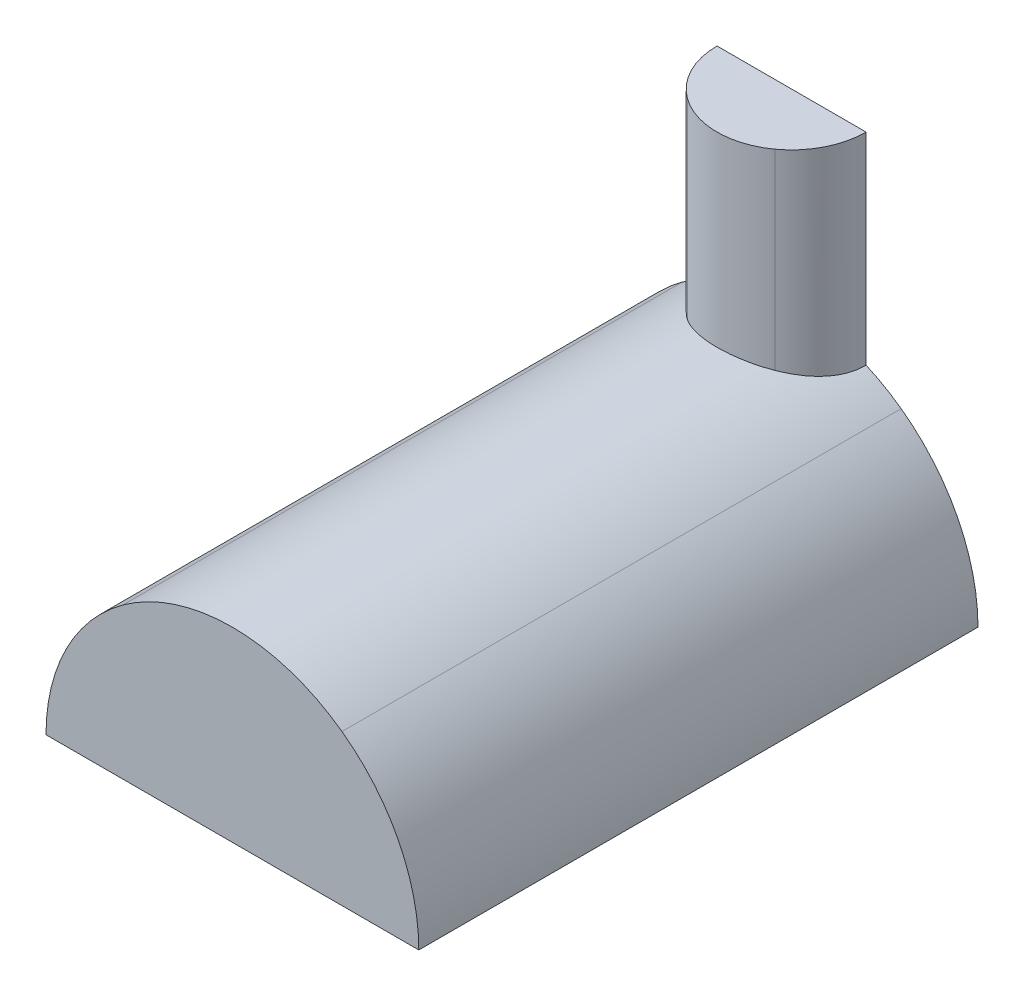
ISO-10303-21;
HEADER;
FILE_DESCRIPTION(('STEP AP214'),'2;1');
FILE_NAME('part.step','',(''),(''),'','','');
FILE_SCHEMA(('AUTOMOTIVE_DESIGN { 1 0 10303 214 1 1 1 1 }'));
ENDSEC;
DATA;
#1=APPLICATION_CONTEXT('core data for automotive mechanical design processes');
#2=APPLICATION_PROTOCOL_DEFINITION('international standard','automotive_design',2000,#1);
#3=PRODUCT_CONTEXT('',#1,'mechanical');
#4=PRODUCT('Part','Part','',(#3));
#5=PRODUCT_RELATED_PRODUCT_CATEGORY('part','',(#4));
#6=PRODUCT_DEFINITION_FORMATION('','',#4);
#7=PRODUCT_DEFINITION_CONTEXT('part definition',#1,'design');
#8=PRODUCT_DEFINITION('design','',#6,#7);
#9=PRODUCT_DEFINITION_SHAPE('','',#8);
#10=(LENGTH_UNIT() NAMED_UNIT(*) SI_UNIT(.MILLI.,.METRE.));
#11=(NAMED_UNIT(*) PLANE_ANGLE_UNIT() SI_UNIT($,.RADIAN.));
#12=(NAMED_UNIT(*) SI_UNIT($,.STERADIAN.) SOLID_ANGLE_UNIT());
#13=UNCERTAINTY_MEASURE_WITH_UNIT(LENGTH_MEASURE(1.E-05),#10,'distance_accuracy_value','');
#14=(GEOMETRIC_REPRESENTATION_CONTEXT(3) GLOBAL_UNCERTAINTY_ASSIGNED_CONTEXT((#13)) GLOBAL_UNIT_ASSIGNED_CONTEXT((#10,
#11,#12)) REPRESENTATION_CONTEXT('',''));
#15=CARTESIAN_POINT('',(0.,0.,0.));
#16=DIRECTION('',(0.,0.,1.));
#17=DIRECTION('',(1.,0.,0.));
#18=AXIS2_PLACEMENT_3D('',#15,#16,#17);
#19=CARTESIAN_POINT('',(0.,2540.,0.));
#20=DIRECTION('',(0.,-1.,0.));
#21=DIRECTION('',(0.,0.,-1.));
#22=AXIS2_PLACEMENT_3D('',#19,#20,#21);
#23=CYLINDRICAL_SURFACE('',#22,508.);
#24=CARTESIAN_POINT('',(508.,1163.97422651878,0.));
#25=CARTESIAN_POINT('',(508.000002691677,1163.97421948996,3.41657036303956));
#26=CARTESIAN_POINT('',(507.96553124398,1163.98927063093,6.83303695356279));
#27=CARTESIAN_POINT('',(507.827685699,1164.04941899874,13.6642900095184));
#28=CARTESIAN_POINT('',(507.724312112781,1164.09451600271,17.0790764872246));
#29=CARTESIAN_POINT('',(507.310928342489,1164.27476094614,27.3182251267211));
#30=CARTESIAN_POINT('',(506.897655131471,1164.45486283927,34.1379353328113));
#31=CARTESIAN_POINT('',(505.797076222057,1164.93333604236,47.7484560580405));
#32=CARTESIAN_POINT('',(505.109872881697,1165.23166317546,54.5392764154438));
#33=CARTESIAN_POINT('',(503.875094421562,1165.76587971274,64.6956183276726));
#34=CARTESIAN_POINT('',(503.429498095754,1165.95840961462,68.076132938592));
#35=CARTESIAN_POINT('',(502.470583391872,1166.37197565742,74.8260226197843));
#36=CARTESIAN_POINT('',(501.957260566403,1166.59301367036,78.1953969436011));
#37=CARTESIAN_POINT('',(500.320603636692,1167.29632361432,88.2573007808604));
#38=CARTESIAN_POINT('',(499.097253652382,1167.820235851,94.9309441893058));
#39=CARTESIAN_POINT('',(496.386406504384,1168.9750659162,108.215019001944));
#40=CARTESIAN_POINT('',(494.898907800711,1169.60598436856,114.825450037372));
#41=CARTESIAN_POINT('',(492.472444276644,1170.62874519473,124.685008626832));
#42=CARTESIAN_POINT('',(491.631021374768,1170.98242346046,127.962407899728));
#43=CARTESIAN_POINT('',(489.883670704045,1171.71450726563,134.496939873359));
#44=CARTESIAN_POINT('',(488.977747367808,1172.09291110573,137.754073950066));
#45=CARTESIAN_POINT('',(486.163889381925,1173.26416734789,147.493541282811));
#46=CARTESIAN_POINT('',(484.159831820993,1174.09307924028,153.944081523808));
#47=CARTESIAN_POINT('',(479.902748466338,1175.83954560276,166.74165457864));
#48=CARTESIAN_POINT('',(477.650011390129,1176.75699712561,173.088797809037));
#49=CARTESIAN_POINT('',(472.898571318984,1178.67446906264,185.677688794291));
#50=CARTESIAN_POINT('',(470.399868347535,1179.67448946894,191.919436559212));
#51=CARTESIAN_POINT('',(465.161723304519,1181.74976471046,204.288221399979));
#52=CARTESIAN_POINT('',(462.42228410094,1182.82501864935,210.41525984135));
#53=CARTESIAN_POINT('',(456.708029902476,1185.04310814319,222.546015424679));
#54=CARTESIAN_POINT('',(453.733214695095,1186.18594375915,228.549732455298));
#55=CARTESIAN_POINT('',(447.550882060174,1188.53235046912,240.431052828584));
#56=CARTESIAN_POINT('',(444.343163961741,1189.73597365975,246.308541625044));
#57=CARTESIAN_POINT('',(439.363281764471,1191.5800600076,255.019794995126));
#58=CARTESIAN_POINT('',(437.675252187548,1192.20120389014,257.90607826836));
#59=CARTESIAN_POINT('',(434.24363111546,1193.45540613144,263.643019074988));
#60=CARTESIAN_POINT('',(432.500036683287,1194.08846511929,266.493674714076));
#61=CARTESIAN_POINT('',(427.187130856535,1196.00390075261,274.990514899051));
#62=CARTESIAN_POINT('',(423.535521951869,1197.30260102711,280.581878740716));
#63=CARTESIAN_POINT('',(416.018946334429,1199.93503733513,291.610654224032));
#64=CARTESIAN_POINT('',(412.15397674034,1201.26877384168,297.048063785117));
#65=CARTESIAN_POINT('',(404.012474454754,1204.03211589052,308.037418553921));
#66=CARTESIAN_POINT('',(399.724999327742,1205.46312773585,313.580910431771));
#67=CARTESIAN_POINT('',(390.927093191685,1208.3449152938,324.482776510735));
#68=CARTESIAN_POINT('',(386.416660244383,1209.79569117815,329.84114910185));
#69=CARTESIAN_POINT('',(377.179505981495,1212.70733150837,340.365457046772));
#70=CARTESIAN_POINT('',(372.452778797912,1214.16819622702,345.531387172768));
#71=CARTESIAN_POINT('',(362.789808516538,1217.09039507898,355.663548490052));
#72=CARTESIAN_POINT('',(357.853566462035,1218.55172920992,360.629780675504));
#73=CARTESIAN_POINT('',(350.297111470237,1220.73699580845,367.92417182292));
#74=CARTESIAN_POINT('',(347.752580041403,1221.46439626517,370.330133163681));
#75=CARTESIAN_POINT('',(342.613932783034,1222.91570469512,375.089264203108));
#76=CARTESIAN_POINT('',(340.019819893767,1223.63961287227,377.442437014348));
#77=CARTESIAN_POINT('',(332.164116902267,1225.80443174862,384.421737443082));
#78=CARTESIAN_POINT('',(326.829045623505,1227.23847067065,388.967759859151));
#79=CARTESIAN_POINT('',(315.970969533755,1230.07879425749,397.838531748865));
#80=CARTESIAN_POINT('',(310.447961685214,1231.48507847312,402.163277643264));
#81=CARTESIAN_POINT('',(299.221543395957,1234.26087246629,410.584588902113));
#82=CARTESIAN_POINT('',(293.518131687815,1235.63038198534,414.68115266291));
#83=CARTESIAN_POINT('',(281.709508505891,1238.37713969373,422.796751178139));
#84=CARTESIAN_POINT('',(275.597331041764,1239.75254387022,426.806280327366));
#85=CARTESIAN_POINT('',(263.196175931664,1242.44437757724,434.563301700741));
#86=CARTESIAN_POINT('',(256.907197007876,1243.76080668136,438.310792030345));
#87=CARTESIAN_POINT('',(244.162243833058,1246.32541982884,445.53614916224));
#88=CARTESIAN_POINT('',(237.706262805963,1247.57360109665,449.014005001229));
#89=CARTESIAN_POINT('',(224.638225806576,1249.99272912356,455.692341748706));
#90=CARTESIAN_POINT('',(218.026170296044,1251.16367611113,458.892823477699));
#91=CARTESIAN_POINT('',(204.659412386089,1253.41950242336,465.008090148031));
#92=CARTESIAN_POINT('',(197.90475611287,1254.50440905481,467.92296580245));
#93=CARTESIAN_POINT('',(184.262740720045,1256.58061626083,473.461123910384));
#94=CARTESIAN_POINT('',(177.375381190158,1257.57191654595,476.084405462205));
#95=CARTESIAN_POINT('',(163.481065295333,1259.45348715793,481.032558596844));
#96=CARTESIAN_POINT('',(156.474114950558,1260.34376255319,483.357445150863));
#97=CARTESIAN_POINT('',(142.353770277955,1262.01661911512,487.702746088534));
#98=CARTESIAN_POINT('',(135.240377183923,1262.79920152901,489.723163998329));
#99=CARTESIAN_POINT('',(121.267982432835,1264.21555557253,493.363602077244));
#100=CARTESIAN_POINT('',(114.413338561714,1264.85469753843,494.998271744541));
#101=CARTESIAN_POINT('',(100.633210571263,1266.02558048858,497.982584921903));
#102=CARTESIAN_POINT('',(93.707727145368,1266.55732252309,499.332231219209));
#103=CARTESIAN_POINT('',(79.7992406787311,1267.50963241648,501.742856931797));
#104=CARTESIAN_POINT('',(72.8162387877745,1267.93020249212,502.803842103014));
#105=CARTESIAN_POINT('',(58.806185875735,1268.65717769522,504.634263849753));
#106=CARTESIAN_POINT('',(51.7791347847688,1268.9635826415,505.40369996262));
#107=CARTESIAN_POINT('',(37.6970531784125,1269.45994620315,506.648676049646));
#108=CARTESIAN_POINT('',(30.642031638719,1269.64993954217,507.12430366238));
#109=CARTESIAN_POINT('',(16.5160751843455,1269.91224968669,507.780673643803));
#110=CARTESIAN_POINT('',(9.44514023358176,1269.98456622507,507.961415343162));
#111=CARTESIAN_POINT('',(-4.69810803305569,1270.01099788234,508.027494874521));
#112=CARTESIAN_POINT('',(-11.7704213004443,1269.96511659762,507.9128416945));
#113=CARTESIAN_POINT('',(-25.9022950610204,1269.75549135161,507.388476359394));
#114=CARTESIAN_POINT('',(-32.9618556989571,1269.59174873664,506.978767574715));
#115=CARTESIAN_POINT('',(-46.6574628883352,1269.16009440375,505.896803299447));
#116=CARTESIAN_POINT('',(-53.2949871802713,1268.89856294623,505.240619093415));
#117=CARTESIAN_POINT('',(-66.5342551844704,1268.27327843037,503.668173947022));
#118=CARTESIAN_POINT('',(-73.1359992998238,1267.90952652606,502.751915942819));
#119=CARTESIAN_POINT('',(-86.2919182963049,1267.08213797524,500.661627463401));
#120=CARTESIAN_POINT('',(-92.8460953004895,1266.61850581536,499.487608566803));
#121=CARTESIAN_POINT('',(-105.895982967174,1265.5942787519,496.884604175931));
#122=CARTESIAN_POINT('',(-112.391693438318,1265.03368353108,495.455617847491));
#123=CARTESIAN_POINT('',(-125.313837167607,1263.81903671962,492.346022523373));
#124=CARTESIAN_POINT('',(-131.740269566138,1263.16498397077,490.665410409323));
#125=CARTESIAN_POINT('',(-144.513306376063,1261.76748280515,487.056411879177));
#126=CARTESIAN_POINT('',(-150.859910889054,1261.02403450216,485.12802577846));
#127=CARTESIAN_POINT('',(-163.463410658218,1259.45227951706,481.027680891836));
#128=CARTESIAN_POINT('',(-169.72030405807,1258.62397108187,478.855717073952));
#129=CARTESIAN_POINT('',(-182.134696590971,1256.88751935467,474.272846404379));
#130=CARTESIAN_POINT('',(-188.292195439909,1255.97937583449,471.861938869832));
#131=CARTESIAN_POINT('',(-200.590404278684,1254.0744746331,466.768091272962));
#132=CARTESIAN_POINT('',(-206.729472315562,1253.07659064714,464.081608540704));
#133=CARTESIAN_POINT('',(-218.886814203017,1251.01022427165,458.472875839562));
#134=CARTESIAN_POINT('',(-224.905087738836,1249.94174169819,455.550625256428));
#135=CARTESIAN_POINT('',(-236.812264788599,1247.74060127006,449.475941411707));
#136=CARTESIAN_POINT('',(-242.701168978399,1246.60794375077,446.323509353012));
#137=CARTESIAN_POINT('',(-254.341559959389,1244.28517431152,439.794160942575));
#138=CARTESIAN_POINT('',(-260.093046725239,1243.09506238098,436.417244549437));
#139=CARTESIAN_POINT('',(-271.452525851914,1240.66404515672,429.443774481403));
#140=CARTESIAN_POINT('',(-277.060478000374,1239.42312587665,425.847160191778));
#141=CARTESIAN_POINT('',(-288.123944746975,1236.89805044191,418.441041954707));
#142=CARTESIAN_POINT('',(-293.579459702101,1235.6138943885,414.631538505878));
#143=CARTESIAN_POINT('',(-304.331335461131,1233.00974663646,406.805422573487));
#144=CARTESIAN_POINT('',(-309.627691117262,1231.68975378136,402.788803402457));
#145=CARTESIAN_POINT('',(-320.05442174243,1229.02161424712,394.554558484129));
#146=CARTESIAN_POINT('',(-325.184795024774,1227.67346728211,390.336930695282));
#147=CARTESIAN_POINT('',(-335.604470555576,1224.86759529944,381.423223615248));
#148=CARTESIAN_POINT('',(-340.882104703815,1223.40848561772,376.71391020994));
#149=CARTESIAN_POINT('',(-348.645804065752,1221.20978558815,369.489650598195));
#150=CARTESIAN_POINT('',(-351.208286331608,1220.47520076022,367.054807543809));
#151=CARTESIAN_POINT('',(-356.281718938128,1219.00381994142,362.132337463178));
#152=CARTESIAN_POINT('',(-358.792666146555,1218.26702381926,359.644707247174));
#153=CARTESIAN_POINT('',(-366.246590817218,1216.05522059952,352.104239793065));
#154=CARTESIAN_POINT('',(-371.110861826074,1214.57873887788,346.973629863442));
#155=CARTESIAN_POINT('',(-380.621889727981,1211.63186002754,336.512924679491));
#156=CARTESIAN_POINT('',(-385.268646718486,1210.16146289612,331.182829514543));
#157=CARTESIAN_POINT('',(-392.071326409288,1207.96761405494,323.042705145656));
#158=CARTESIAN_POINT('',(-394.311563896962,1207.23809197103,320.304401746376));
#159=CARTESIAN_POINT('',(-398.73486968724,1205.78436009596,314.780910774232));
#160=CARTESIAN_POINT('',(-400.917941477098,1205.0601499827,311.995726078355));
#161=CARTESIAN_POINT('',(-407.38040858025,1202.89726991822,303.5709232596));
#162=CARTESIAN_POINT('',(-411.573158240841,1201.46831706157,297.861933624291));
#163=CARTESIAN_POINT('',(-419.72005238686,1198.64659643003,286.26784473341));
#164=CARTESIAN_POINT('',(-423.674199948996,1197.25382818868,280.382747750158));
#165=CARTESIAN_POINT('',(-431.337318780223,1194.514409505,268.444458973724));
#166=CARTESIAN_POINT('',(-435.046288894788,1193.16775927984,262.391266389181));
#167=CARTESIAN_POINT('',(-442.315595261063,1190.49248002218,249.948626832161));
#168=CARTESIAN_POINT('',(-445.868558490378,1189.16549118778,243.554517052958));
#169=CARTESIAN_POINT('',(-452.700452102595,1186.58149306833,230.607621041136));
#170=CARTESIAN_POINT('',(-455.979380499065,1185.32448429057,224.054833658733));
#171=CARTESIAN_POINT('',(-462.256400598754,1182.89067703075,210.800372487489));
#172=CARTESIAN_POINT('',(-465.254455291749,1181.71388912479,204.098679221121));
#173=CARTESIAN_POINT('',(-470.962190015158,1179.45073729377,190.55863168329));
#174=CARTESIAN_POINT('',(-473.671872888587,1178.36437247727,183.720278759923));
#175=CARTESIAN_POINT('',(-478.792229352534,1176.29316821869,169.92945483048));
#176=CARTESIAN_POINT('',(-481.203352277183,1175.30817659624,162.977173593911));
#177=CARTESIAN_POINT('',(-485.725090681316,1173.44668208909,148.960939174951));
#178=CARTESIAN_POINT('',(-487.835697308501,1172.57018240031,141.896982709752));
#179=CARTESIAN_POINT('',(-491.749625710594,1170.93415830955,127.674148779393));
#180=CARTESIAN_POINT('',(-493.553068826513,1170.17458772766,120.515310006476));
#181=CARTESIAN_POINT('',(-496.848258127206,1168.77928346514,106.114810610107));
#182=CARTESIAN_POINT('',(-498.340039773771,1168.14353569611,98.8731595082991));
#183=CARTESIAN_POINT('',(-500.364649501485,1167.277077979,87.8288475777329));
#184=CARTESIAN_POINT('',(-501.013155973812,1166.99882215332,84.0507111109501));
#185=CARTESIAN_POINT('',(-502.224794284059,1166.47790049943,76.4784611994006));
#186=CARTESIAN_POINT('',(-502.787930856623,1166.23523269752,72.6843486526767));
#187=CARTESIAN_POINT('',(-503.828237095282,1165.7861845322,65.0831744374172));
#188=CARTESIAN_POINT('',(-504.305427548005,1165.57979539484,61.276116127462));
#189=CARTESIAN_POINT('',(-505.173597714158,1165.20378476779,53.6503714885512));
#190=CARTESIAN_POINT('',(-505.564577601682,1165.03416320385,49.831685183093));
#191=CARTESIAN_POINT('',(-506.259764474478,1164.73224156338,42.1873388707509));
#192=CARTESIAN_POINT('',(-506.564025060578,1164.59991843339,38.3616846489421));
#193=CARTESIAN_POINT('',(-507.085824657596,1164.37281265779,30.7033728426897));
#194=CARTESIAN_POINT('',(-507.303364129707,1164.27802981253,26.8707152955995));
#195=CARTESIAN_POINT('',(-507.651575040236,1164.12624596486,19.1995729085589));
#196=CARTESIAN_POINT('',(-507.782220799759,1164.06925613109,15.3610866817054));
#197=CARTESIAN_POINT('',(-507.956440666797,1163.99323693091,7.68173437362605));
#198=CARTESIAN_POINT('',(-508.000014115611,1163.97420785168,3.84086827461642));
#199=CARTESIAN_POINT('',(-508.,1163.97422651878,2.26642889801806E-13));
#200=B_SPLINE_CURVE_WITH_KNOTS('',3,(#24,#25,#26,#27,#28,#29,#30,#31,#32,#33,#34,#35,#36,#37,
#38,#39,#40,#41,#42,#43,#44,#45,#46,#47,#48,#49,#50,#51,#52,#53,#54,#55,#56,#57,#58,#59,#60,#61,
#62,#63,#64,#65,#66,#67,#68,#69,#70,#71,#72,#73,#74,#75,#76,#77,#78,#79,#80,#81,#82,#83,#84,#85,
#86,#87,#88,#89,#90,#91,#92,#93,#94,#95,#96,#97,#98,#99,#100,#101,#102,#103,#104,#105,#106,#107,
#108,#109,#110,#111,#112,#113,#114,#115,#116,#117,#118,#119,#120,#121,#122,#123,#124,#125,#126,
#127,#128,#129,#130,#131,#132,#133,#134,#135,#136,#137,#138,#139,#140,#141,#142,#143,#144,#145,
#146,#147,#148,#149,#150,#151,#152,#153,#154,#155,#156,#157,#158,#159,#160,#161,#162,#163,#164,
#165,#166,#167,#168,#169,#170,#171,#172,#173,#174,#175,#176,#177,#178,#179,#180,#181,#182,#183,
#184,#185,#186,#187,#188,#189,#190,#191,#192,#193,#194,#195,#196,#197,#198,#199),.UNSPECIFIED.,
.F.,.F.,(4,2,2,2,2,2,2,2,2,2,2,2,2,2,2,2,2,2,2,2,2,2,2,2,2,2,2,2,2,2,2,2,2,2,2,2,2,2,2,2,2,2,2,
2,2,2,2,2,2,2,2,2,2,2,2,2,2,2,2,2,2,2,2,2,2,2,2,2,2,2,2,2,2,2,2,2,2,2,2,2,2,2,2,2,2,2,2,4),(0.,
10.2492969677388,20.498517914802,40.9952847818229,61.484399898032,71.7292542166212,
81.9747816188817,102.383189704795,122.791716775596,132.997410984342,143.202404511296,
163.611951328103,183.99804699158,204.384140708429,224.769991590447,245.15586087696,
265.559508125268,275.76153902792,285.964110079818,306.368177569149,326.772520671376,
348.224500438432,369.676666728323,391.129415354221,412.582057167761,423.311362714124,
434.040033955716,455.496879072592,476.954071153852,498.411414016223,520.719075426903,
543.026898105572,565.335627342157,587.644290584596,609.945845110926,632.247468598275,
654.547972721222,676.848218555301,698.068784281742,719.289142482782,740.509077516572,
761.729046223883,782.942682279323,804.156366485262,825.369405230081,846.582201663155,
866.601318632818,886.620209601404,906.638201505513,926.656258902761,946.674564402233,
966.692844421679,986.711538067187,1006.73028892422,1027.0497859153,1047.36933584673,
1067.68877959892,1088.00822709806,1108.33330628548,1128.65833787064,1148.98402613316,
1169.3099208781,1190.96982650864,1201.80013761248,1212.63110503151,1234.29215947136,
1255.95320420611,1266.78962665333,1277.62538650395,1299.29641632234,1320.96716663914,
1342.63801899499,1364.93394851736,1387.23003964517,1409.52906456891,1431.82786962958,
1454.09269611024,1476.35817830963,1498.6148443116,1520.86897650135,1532.39844988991,
1543.92728361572,1555.45332526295,1566.97934363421,1578.49822229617,1590.0170396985,
1601.53925963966,1613.06156674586),.UNSPECIFIED.);
#201=CARTESIAN_POINT('',(-298.594908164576,1234.39907680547,410.980633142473));
#202=VERTEX_POINT('',#201);
#203=CARTESIAN_POINT('',(-508.,1163.97422651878,0.));
#204=VERTEX_POINT('',#203);
#205=EDGE_CURVE('E125',#202,#204,#200,.T.);
#206=ORIENTED_EDGE('',*,*,#205,.F.);
#207=DIRECTION('',(0.,1.,0.));
#208=VECTOR('',#207,1.);
#209=CARTESIAN_POINT('',(-298.594908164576,2540.,410.980633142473));
#210=LINE('',#209,#208);
#211=CARTESIAN_POINT('',(-298.594908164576,2540.,410.980633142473));
#212=VERTEX_POINT('',#211);
#213=EDGE_CURVE('E12',#202,#212,#210,.T.);
#214=ORIENTED_EDGE('',*,*,#213,.T.);
#215=CARTESIAN_POINT('',(0.,2540.,0.));
#216=DIRECTION('',(0.,-1.,0.));
#217=DIRECTION('',(0.,0.,-1.));
#218=AXIS2_PLACEMENT_3D('',#215,#216,#217);
#219=CIRCLE('',#218,508.);
#220=CARTESIAN_POINT('',(-508.,2540.,0.));
#221=VERTEX_POINT('',#220);
#222=EDGE_CURVE('E99',#212,#221,#219,.T.);
#223=ORIENTED_EDGE('',*,*,#222,.T.);
#224=DIRECTION('',(0.,-1.,0.));
#225=VECTOR('',#224,1.);
#226=CARTESIAN_POINT('',(-508.,2540.,0.));
#227=LINE('',#226,#225);
#228=EDGE_CURVE('E101',#221,#204,#227,.T.);
#229=ORIENTED_EDGE('',*,*,#228,.T.);
#230=EDGE_LOOP('',(#206,#214,#223,#229));
#231=FACE_BOUND('',#230,.T.);
#232=ADVANCED_FACE('F38',(#231),#23,.T.);
#233=ORIENTED_EDGE('',*,*,#213,.F.);
#234=CARTESIAN_POINT('',(298.594908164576,1234.39907680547,410.980633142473));
#235=VERTEX_POINT('',#234);
#236=EDGE_CURVE('E135',#235,#202,#200,.T.);
#237=ORIENTED_EDGE('',*,*,#236,.F.);
#238=DIRECTION('',(0.,1.,0.));
#239=VECTOR('',#238,1.);
#240=CARTESIAN_POINT('',(298.594908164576,2540.,410.980633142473));
#241=LINE('',#240,#239);
#242=CARTESIAN_POINT('',(298.594908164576,2540.,410.980633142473));
#243=VERTEX_POINT('',#242);
#244=EDGE_CURVE('E47',#235,#243,#241,.T.);
#245=ORIENTED_EDGE('',*,*,#244,.T.);
#246=EDGE_CURVE('E105',#243,#212,#219,.T.);
#247=ORIENTED_EDGE('',*,*,#246,.T.);
#248=EDGE_LOOP('',(#233,#237,#245,#247));
#249=FACE_BOUND('',#248,.T.);
#250=ADVANCED_FACE('F144',(#249),#23,.T.);
#251=CARTESIAN_POINT('',(0.,0.,3810.));
#252=DIRECTION('',(0.,0.,-1.));
#253=DIRECTION('',(-1.,0.,0.));
#254=AXIS2_PLACEMENT_3D('',#251,#252,#253);
#255=CYLINDRICAL_SURFACE('',#254,1270.);
#256=CARTESIAN_POINT('',(0.,0.,0.));
#257=DIRECTION('',(0.,0.,1.));
#258=DIRECTION('',(1.,0.,0.));
#259=AXIS2_PLACEMENT_3D('',#256,#257,#258);
#260=CIRCLE('',#259,1270.);
#261=CARTESIAN_POINT('',(-746.487270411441,1027.45158285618,0.));
#262=VERTEX_POINT('',#261);
#263=EDGE_CURVE('E117',#204,#262,#260,.T.);
#264=ORIENTED_EDGE('',*,*,#263,.T.);
#265=DIRECTION('',(0.,0.,1.));
#266=VECTOR('',#265,1.);
#267=CARTESIAN_POINT('',(-746.487270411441,1027.45158285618,3810.));
#268=LINE('',#267,#266);
#269=CARTESIAN_POINT('',(-746.487270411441,1027.45158285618,3810.));
#270=VERTEX_POINT('',#269);
#271=EDGE_CURVE('E172',#262,#270,#268,.T.);
#272=ORIENTED_EDGE('',*,*,#271,.T.);
#273=CARTESIAN_POINT('',(0.,0.,3810.));
#274=DIRECTION('',(0.,0.,1.));
#275=DIRECTION('',(1.,0.,0.));
#276=AXIS2_PLACEMENT_3D('',#273,#274,#275);
#277=CIRCLE('',#276,1270.);
#278=CARTESIAN_POINT('',(746.487270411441,1027.45158285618,3810.));
#279=VERTEX_POINT('',#278);
#280=EDGE_CURVE('E186',#279,#270,#277,.T.);
#281=ORIENTED_EDGE('',*,*,#280,.F.);
#282=DIRECTION('',(0.,0.,1.));
#283=VECTOR('',#282,1.);
#284=CARTESIAN_POINT('',(746.487270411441,1027.45158285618,3810.));
#285=LINE('',#284,#283);
#286=CARTESIAN_POINT('',(746.487270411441,1027.45158285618,0.));
#287=VERTEX_POINT('',#286);
#288=EDGE_CURVE('E193',#287,#279,#285,.T.);
#289=ORIENTED_EDGE('',*,*,#288,.F.);
#290=CARTESIAN_POINT('',(508.,1163.97422651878,0.));
#291=VERTEX_POINT('',#290);
#292=EDGE_CURVE('E175',#287,#291,#260,.T.);
#293=ORIENTED_EDGE('',*,*,#292,.T.);
#294=EDGE_CURVE('E127',#291,#235,#200,.T.);
#295=ORIENTED_EDGE('',*,*,#294,.T.);
#296=ORIENTED_EDGE('',*,*,#236,.T.);
#297=ORIENTED_EDGE('',*,*,#205,.T.);
#298=EDGE_LOOP('',(#264,#272,#281,#289,#293,#295,#296,#297));
#299=FACE_BOUND('',#298,.T.);
#300=ADVANCED_FACE('F158',(#299),#255,.T.);
#301=CARTESIAN_POINT('',(1270.,0.,0.));
#302=VERTEX_POINT('',#301);
#303=EDGE_CURVE('E177',#302,#287,#260,.T.);
#304=ORIENTED_EDGE('',*,*,#303,.T.);
#305=ORIENTED_EDGE('',*,*,#288,.T.);
#306=CARTESIAN_POINT('',(1270.,0.,3810.));
#307=VERTEX_POINT('',#306);
#308=EDGE_CURVE('E136',#307,#279,#277,.T.);
#309=ORIENTED_EDGE('',*,*,#308,.F.);
#310=DIRECTION('',(0.,0.,-1.));
#311=VECTOR('',#310,1.);
#312=CARTESIAN_POINT('',(1270.,0.,3810.));
#313=LINE('',#312,#311);
#314=EDGE_CURVE('E188',#307,#302,#313,.T.);
#315=ORIENTED_EDGE('',*,*,#314,.T.);
#316=EDGE_LOOP('',(#304,#305,#309,#315));
#317=FACE_BOUND('',#316,.T.);
#318=ADVANCED_FACE('F156',(#317),#255,.T.);
#319=ORIENTED_EDGE('',*,*,#271,.F.);
#320=CARTESIAN_POINT('',(-1270.,0.,0.));
#321=VERTEX_POINT('',#320);
#322=EDGE_CURVE('E134',#262,#321,#260,.T.);
#323=ORIENTED_EDGE('',*,*,#322,.T.);
#324=DIRECTION('',(0.,0.,-1.));
#325=VECTOR('',#324,1.);
#326=CARTESIAN_POINT('',(-1270.,0.,3810.));
#327=LINE('',#326,#325);
#328=CARTESIAN_POINT('',(-1270.,0.,3810.));
#329=VERTEX_POINT('',#328);
#330=EDGE_CURVE('E190',#329,#321,#327,.T.);
#331=ORIENTED_EDGE('',*,*,#330,.F.);
#332=EDGE_CURVE('E182',#270,#329,#277,.T.);
#333=ORIENTED_EDGE('',*,*,#332,.F.);
#334=EDGE_LOOP('',(#319,#323,#331,#333));
#335=FACE_BOUND('',#334,.T.);
#336=ADVANCED_FACE('F40',(#335),#255,.T.);
#337=CARTESIAN_POINT('',(-1270.,0.,3810.));
#338=DIRECTION('',(0.,1.,0.));
#339=DIRECTION('',(0.,0.,1.));
#340=AXIS2_PLACEMENT_3D('',#337,#338,#339);
#341=PLANE('',#340);
#342=DIRECTION('',(1.,0.,0.));
#343=VECTOR('',#342,1.);
#344=CARTESIAN_POINT('',(-1270.,0.,0.));
#345=LINE('',#344,#343);
#346=EDGE_CURVE('E180',#321,#302,#345,.T.);
#347=ORIENTED_EDGE('',*,*,#346,.T.);
#348=ORIENTED_EDGE('',*,*,#314,.F.);
#349=DIRECTION('',(1.,0.,0.));
#350=VECTOR('',#349,1.);
#351=CARTESIAN_POINT('',(-1270.,0.,3810.));
#352=LINE('',#351,#350);
#353=EDGE_CURVE('E191',#329,#307,#352,.T.);
#354=ORIENTED_EDGE('',*,*,#353,.F.);
#355=ORIENTED_EDGE('',*,*,#330,.T.);
#356=EDGE_LOOP('',(#347,#348,#354,#355));
#357=FACE_BOUND('',#356,.T.);
#358=ADVANCED_FACE('F148',(#357),#341,.F.);
#359=CARTESIAN_POINT('',(0.,0.,3810.));
#360=DIRECTION('',(0.,0.,1.));
#361=DIRECTION('',(1.,0.,0.));
#362=AXIS2_PLACEMENT_3D('',#359,#360,#361);
#363=PLANE('',#362);
#364=ORIENTED_EDGE('',*,*,#308,.T.);
#365=ORIENTED_EDGE('',*,*,#280,.T.);
#366=ORIENTED_EDGE('',*,*,#332,.T.);
#367=ORIENTED_EDGE('',*,*,#353,.T.);
#368=EDGE_LOOP('',(#364,#365,#366,#367));
#369=FACE_BOUND('',#368,.T.);
#370=ADVANCED_FACE('F145',(#369),#363,.T.);
#371=CARTESIAN_POINT('',(0.,0.,0.));
#372=DIRECTION('',(0.,0.,1.));
#373=DIRECTION('',(1.,0.,0.));
#374=AXIS2_PLACEMENT_3D('',#371,#372,#373);
#375=PLANE('',#374);
#376=ORIENTED_EDGE('',*,*,#303,.F.);
#377=ORIENTED_EDGE('',*,*,#346,.F.);
#378=ORIENTED_EDGE('',*,*,#322,.F.);
#379=ORIENTED_EDGE('',*,*,#263,.F.);
#380=ORIENTED_EDGE('',*,*,#228,.F.);
#381=DIRECTION('',(1.,0.,0.));
#382=VECTOR('',#381,1.);
#383=CARTESIAN_POINT('',(508.,2540.,0.));
#384=LINE('',#383,#382);
#385=CARTESIAN_POINT('',(508.,2540.,0.));
#386=VERTEX_POINT('',#385);
#387=EDGE_CURVE('E114',#221,#386,#384,.T.);
#388=ORIENTED_EDGE('',*,*,#387,.T.);
#389=DIRECTION('',(0.,-1.,0.));
#390=VECTOR('',#389,1.);
#391=CARTESIAN_POINT('',(508.,2540.,0.));
#392=LINE('',#391,#390);
#393=EDGE_CURVE('E118',#386,#291,#392,.T.);
#394=ORIENTED_EDGE('',*,*,#393,.T.);
#395=ORIENTED_EDGE('',*,*,#292,.F.);
#396=EDGE_LOOP('',(#376,#377,#378,#379,#380,#388,#394,#395));
#397=FACE_BOUND('',#396,.T.);
#398=ADVANCED_FACE('F112',(#397),#375,.F.);
#399=ORIENTED_EDGE('',*,*,#244,.F.);
#400=ORIENTED_EDGE('',*,*,#294,.F.);
#401=ORIENTED_EDGE('',*,*,#393,.F.);
#402=EDGE_CURVE('E107',#386,#243,#219,.T.);
#403=ORIENTED_EDGE('',*,*,#402,.T.);
#404=EDGE_LOOP('',(#399,#400,#401,#403));
#405=FACE_BOUND('',#404,.T.);
#406=ADVANCED_FACE('F138',(#405),#23,.T.);
#407=CARTESIAN_POINT('',(0.,2540.,0.));
#408=DIRECTION('',(0.,-1.,0.));
#409=DIRECTION('',(0.,0.,-1.));
#410=AXIS2_PLACEMENT_3D('',#407,#408,#409);
#411=PLANE('',#410);
#412=ORIENTED_EDGE('',*,*,#402,.F.);
#413=ORIENTED_EDGE('',*,*,#387,.F.);
#414=ORIENTED_EDGE('',*,*,#222,.F.);
#415=ORIENTED_EDGE('',*,*,#246,.F.);
#416=EDGE_LOOP('',(#412,#413,#414,#415));
#417=FACE_BOUND('',#416,.T.);
#418=ADVANCED_FACE('F121',(#417),#411,.F.);
#419=CLOSED_SHELL('',(#232,#250,#300,#318,#336,#358,#370,#398,#406,#418));
#420=MANIFOLD_SOLID_BREP('B2',#419);
#421=ADVANCED_BREP_SHAPE_REPRESENTATION('',(#18,#420),#14);
#422=SHAPE_DEFINITION_REPRESENTATION(#9,#421);
ENDSEC;
END-ISO-10303-21;
